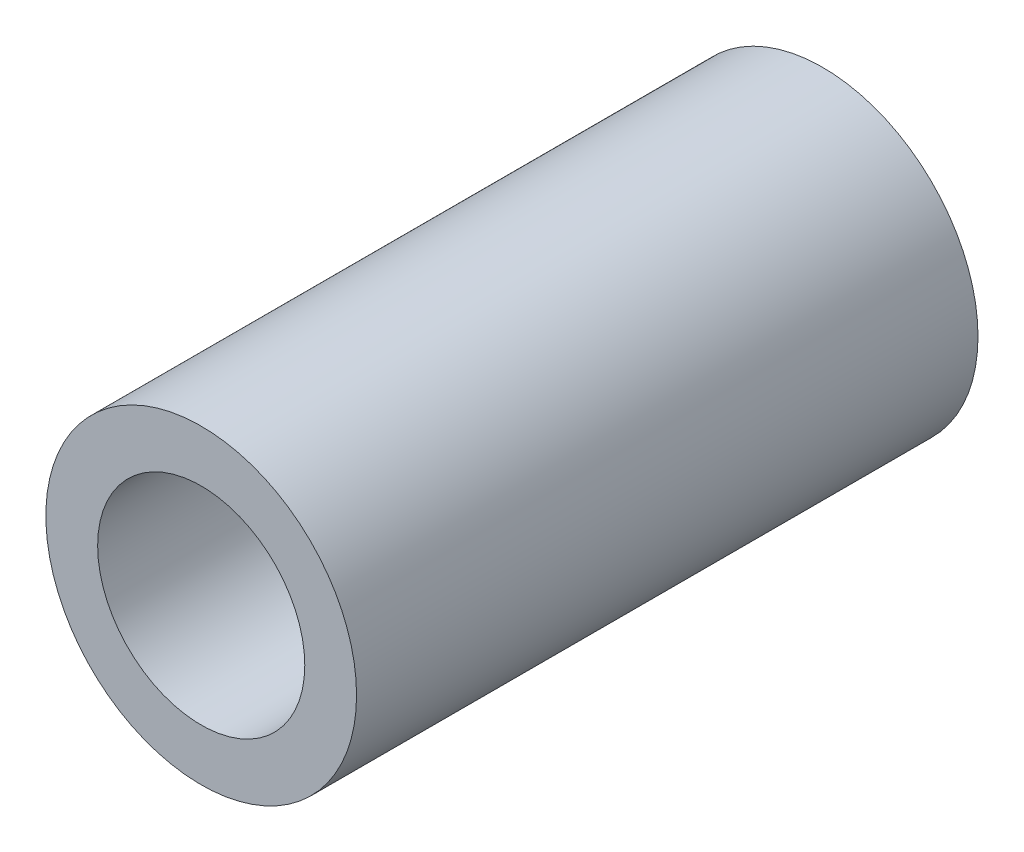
ISO-10303-21;
HEADER;
FILE_DESCRIPTION(('STEP AP214'),'2;1');
FILE_NAME('part.step','',(''),(''),'','','');
FILE_SCHEMA(('AUTOMOTIVE_DESIGN { 1 0 10303 214 1 1 1 1 }'));
ENDSEC;
DATA;
#1=APPLICATION_CONTEXT('core data for automotive mechanical design processes');
#2=APPLICATION_PROTOCOL_DEFINITION('international standard','automotive_design',2000,#1);
#3=PRODUCT_CONTEXT('',#1,'mechanical');
#4=PRODUCT('Part','Part','',(#3));
#5=PRODUCT_RELATED_PRODUCT_CATEGORY('part','',(#4));
#6=PRODUCT_DEFINITION_FORMATION('','',#4);
#7=PRODUCT_DEFINITION_CONTEXT('part definition',#1,'design');
#8=PRODUCT_DEFINITION('design','',#6,#7);
#9=PRODUCT_DEFINITION_SHAPE('','',#8);
#10=(LENGTH_UNIT() NAMED_UNIT(*) SI_UNIT(.MILLI.,.METRE.));
#11=(NAMED_UNIT(*) PLANE_ANGLE_UNIT() SI_UNIT($,.RADIAN.));
#12=(NAMED_UNIT(*) SI_UNIT($,.STERADIAN.) SOLID_ANGLE_UNIT());
#13=UNCERTAINTY_MEASURE_WITH_UNIT(LENGTH_MEASURE(1.E-05),#10,'distance_accuracy_value','');
#14=(GEOMETRIC_REPRESENTATION_CONTEXT(3) GLOBAL_UNCERTAINTY_ASSIGNED_CONTEXT((#13)) GLOBAL_UNIT_ASSIGNED_CONTEXT((#10,
#11,#12)) REPRESENTATION_CONTEXT('',''));
#15=CARTESIAN_POINT('',(0.,0.,0.));
#16=DIRECTION('',(0.,0.,1.));
#17=DIRECTION('',(1.,0.,0.));
#18=AXIS2_PLACEMENT_3D('',#15,#16,#17);
#19=CARTESIAN_POINT('',(0.,0.,12.));
#20=DIRECTION('',(0.,0.,1.));
#21=DIRECTION('',(1.,0.,0.));
#22=AXIS2_PLACEMENT_3D('',#19,#20,#21);
#23=PLANE('',#22);
#24=CARTESIAN_POINT('',(0.,0.,12.));
#25=DIRECTION('',(0.,0.,1.));
#26=DIRECTION('',(1.,0.,0.));
#27=AXIS2_PLACEMENT_3D('',#24,#25,#26);
#28=CIRCLE('',#27,3.);
#29=CARTESIAN_POINT('',(3.,0.,12.));
#30=VERTEX_POINT('',#29);
#31=EDGE_CURVE('E10',#30,#30,#28,.T.);
#32=ORIENTED_EDGE('',*,*,#31,.T.);
#33=EDGE_LOOP('',(#32));
#34=FACE_BOUND('',#33,.T.);
#35=CARTESIAN_POINT('',(0.,0.,12.));
#36=DIRECTION('',(0.,0.,1.));
#37=DIRECTION('',(1.,0.,0.));
#38=AXIS2_PLACEMENT_3D('',#35,#36,#37);
#39=CIRCLE('',#38,2.);
#40=CARTESIAN_POINT('',(2.,0.,12.));
#41=VERTEX_POINT('',#40);
#42=EDGE_CURVE('E39',#41,#41,#39,.T.);
#43=ORIENTED_EDGE('',*,*,#42,.F.);
#44=EDGE_LOOP('',(#43));
#45=FACE_BOUND('',#44,.T.);
#46=ADVANCED_FACE('F28',(#34,#45),#23,.T.);
#47=CARTESIAN_POINT('',(0.,0.,0.));
#48=DIRECTION('',(0.,0.,1.));
#49=DIRECTION('',(1.,0.,0.));
#50=AXIS2_PLACEMENT_3D('',#47,#48,#49);
#51=PLANE('',#50);
#52=CARTESIAN_POINT('',(0.,0.,0.));
#53=DIRECTION('',(0.,0.,1.));
#54=DIRECTION('',(1.,0.,0.));
#55=AXIS2_PLACEMENT_3D('',#52,#53,#54);
#56=CIRCLE('',#55,3.);
#57=CARTESIAN_POINT('',(3.,0.,0.));
#58=VERTEX_POINT('',#57);
#59=EDGE_CURVE('E35',#58,#58,#56,.T.);
#60=ORIENTED_EDGE('',*,*,#59,.F.);
#61=EDGE_LOOP('',(#60));
#62=FACE_BOUND('',#61,.T.);
#63=CARTESIAN_POINT('',(0.,0.,0.));
#64=DIRECTION('',(0.,0.,1.));
#65=DIRECTION('',(1.,0.,0.));
#66=AXIS2_PLACEMENT_3D('',#63,#64,#65);
#67=CIRCLE('',#66,2.);
#68=CARTESIAN_POINT('',(2.,0.,0.));
#69=VERTEX_POINT('',#68);
#70=EDGE_CURVE('E43',#69,#69,#67,.T.);
#71=ORIENTED_EDGE('',*,*,#70,.T.);
#72=EDGE_LOOP('',(#71));
#73=FACE_BOUND('',#72,.T.);
#74=ADVANCED_FACE('F49',(#62,#73),#51,.F.);
#75=CARTESIAN_POINT('',(0.,0.,12.));
#76=DIRECTION('',(0.,0.,-1.));
#77=DIRECTION('',(-1.,0.,0.));
#78=AXIS2_PLACEMENT_3D('',#75,#76,#77);
#79=CYLINDRICAL_SURFACE('',#78,3.);
#80=ORIENTED_EDGE('',*,*,#31,.F.);
#81=EDGE_LOOP('',(#80));
#82=FACE_BOUND('',#81,.T.);
#83=ORIENTED_EDGE('',*,*,#59,.T.);
#84=EDGE_LOOP('',(#83));
#85=FACE_BOUND('',#84,.T.);
#86=ADVANCED_FACE('F30',(#82,#85),#79,.T.);
#87=CARTESIAN_POINT('',(0.,0.,12.));
#88=DIRECTION('',(0.,0.,-1.));
#89=DIRECTION('',(-1.,0.,0.));
#90=AXIS2_PLACEMENT_3D('',#87,#88,#89);
#91=CYLINDRICAL_SURFACE('',#90,2.);
#92=ORIENTED_EDGE('',*,*,#42,.T.);
#93=EDGE_LOOP('',(#92));
#94=FACE_BOUND('',#93,.T.);
#95=ORIENTED_EDGE('',*,*,#70,.F.);
#96=EDGE_LOOP('',(#95));
#97=FACE_BOUND('',#96,.T.);
#98=ADVANCED_FACE('F51',(#94,#97),#91,.F.);
#99=CLOSED_SHELL('',(#46,#74,#86,#98));
#100=MANIFOLD_SOLID_BREP('B2',#99);
#101=ADVANCED_BREP_SHAPE_REPRESENTATION('',(#18,#100),#14);
#102=SHAPE_DEFINITION_REPRESENTATION(#9,#101);
ENDSEC;
END-ISO-10303-21;
